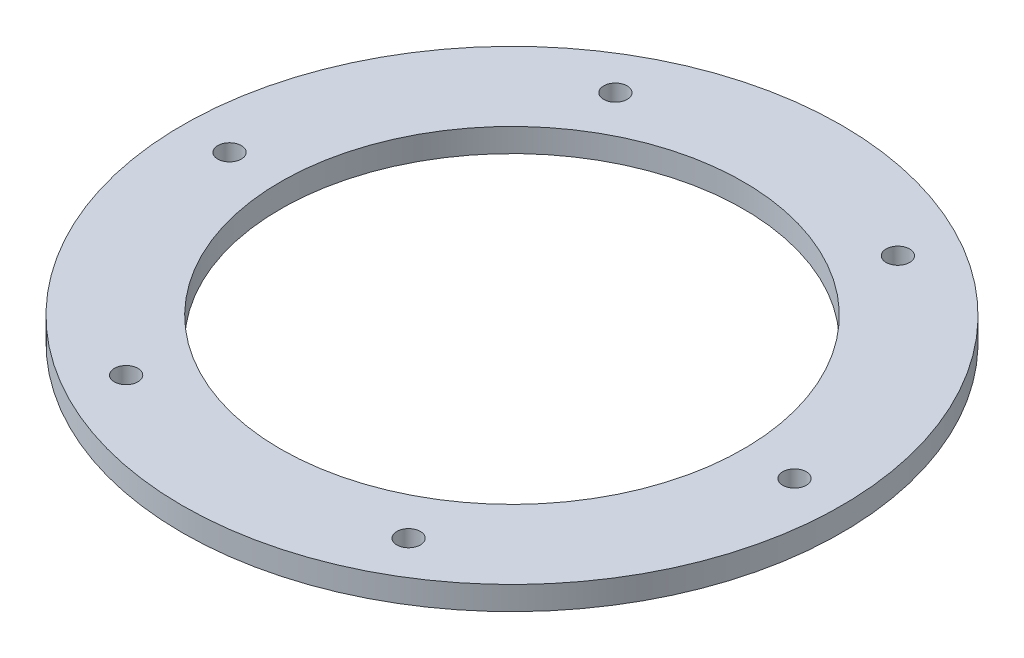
from build123d import *

# Parameters (mm, degrees)
SKETCH1_R           = 42
SKETCH1_R_2         = 29.5
BOSS_EXTRUDE1_DEPTH = 3
BOLT_HOLE_REACH     = 61.473
SKETCH2_R           = 1.5
BOLT_PATTERN_COUNT  = 6


with BuildPart() as part:
    # Sketch1 → Boss-Extrude1 (new body)
    with BuildSketch(Plane(origin=(0, 0, 0), x_dir=(1, 0, 0), z_dir=(0, 1, 0))):
        with Locations(Location((0, 0, 0), (0, 0, 270))):
            Circle(SKETCH1_R)
        with Locations(Location((0, 0, 0), (0, 0, 270))):
            Circle(SKETCH1_R_2, mode=Mode.SUBTRACT)
    extrude(amount=BOSS_EXTRUDE1_DEPTH)

    # Sketch2 → bolt hole (cut, up to next)
    with BuildSketch(Plane(origin=(0, 3, 0), x_dir=(1, 0, 0), z_dir=(0, 1, 0)), mode=Mode.PRIVATE) as bolt_hole_sk1:
        with Locations(Location((36, 0, 0), (0, 0, 270))):
            Circle(SKETCH2_R)
    bolt_hole_tool1 = extrude(bolt_hole_sk1.sketch, amount=-BOLT_HOLE_REACH, mode=Mode.PRIVATE) & part.part
    bolt_hole = bolt_hole_tool1.solids().sort_by_distance((36, 3, 0))[0]
    add(bolt_hole, mode=Mode.SUBTRACT)

    # bolt pattern: bolt hole ×6 about axis
    bolt_pattern_axis = Axis((0, 0, 0), (0, 1, 0))
    for i in range(1, BOLT_PATTERN_COUNT):
        add(bolt_hole.rotate(bolt_pattern_axis, i * 360 / BOLT_PATTERN_COUNT), mode=Mode.SUBTRACT)


solid = part.part
